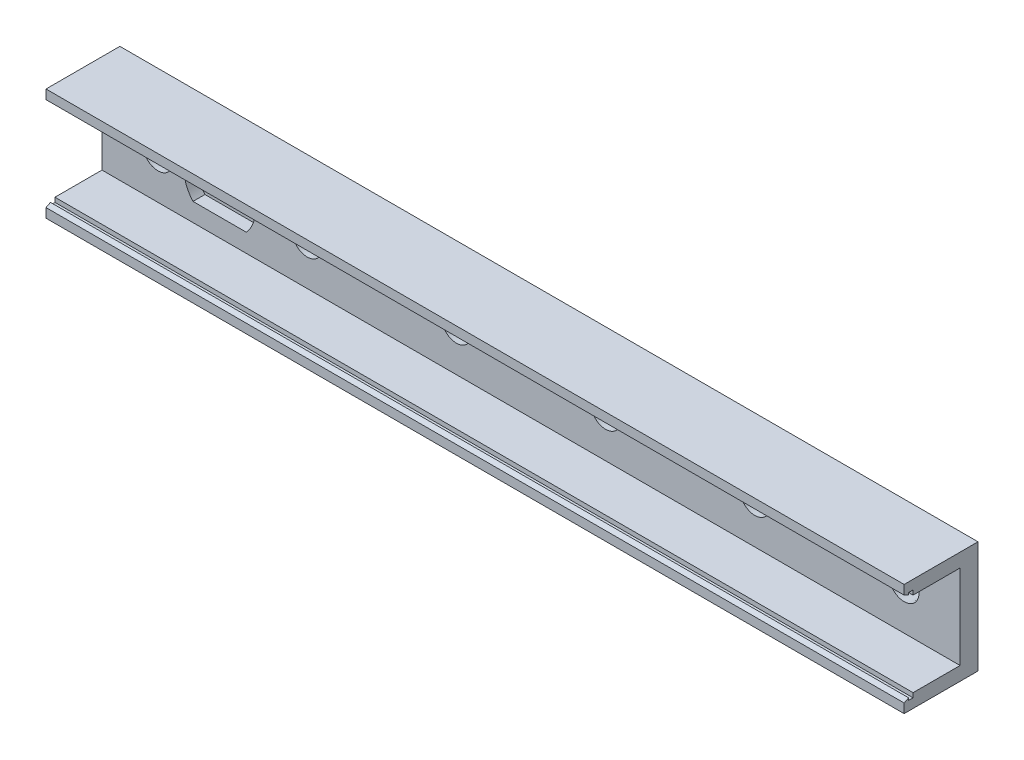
from build123d import *

# Parameters (mm, degrees)
SKETCH1_W                    = 146.05
SKETCH1_H                    = 19.05
BOSS_EXTRUDE1_DEPTH          = 3.048
CUT_EXTRUDE1_DEPTH           = 2.032
SKETCH3_R                    = 3.556
CUT_EXTRUDE2_DEPTH           = 148.301167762
SKETCH4_R                    = 2.54
CUT_EXTRUDE3_DEPTH           = 148.318686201
CUT_EXTRUDE3_DRAFT           = 3
CUT_EXTRUDE3_PROFILE_2_DEPTH = 148.318686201
CUT_EXTRUDE3_PROFILE_2_DRAFT = 3
CUT_EXTRUDE3_PROFILE_3_DEPTH = 148.318686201
CUT_EXTRUDE3_PROFILE_3_DRAFT = 3
CUT_EXTRUDE3_PROFILE_4_DEPTH = 148.318686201
CUT_EXTRUDE3_PROFILE_4_DRAFT = 3
CUT_EXTRUDE3_PROFILE_5_DEPTH = 148.318686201
CUT_EXTRUDE3_PROFILE_5_DRAFT = 3
CUT_EXTRUDE3_PROFILE_6_DEPTH = 148.318686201
CUT_EXTRUDE3_PROFILE_6_DRAFT = 3
BOSS_EXTRUDE2_DEPTH          = 146.05


with BuildPart() as part:
    # Sketch1 → Boss-Extrude1 (new body)
    with BuildSketch(Plane.XY):
        with Locations((73.025, 9.525)):
            Rectangle(SKETCH1_W, SKETCH1_H)
    extrude(amount=BOSS_EXTRUDE1_DEPTH)

    # Sketch2 → Cut-Extrude1 (cut)
    with BuildSketch(Plane.XY.offset(3.048)):
        with BuildLine():
            Line((15.487003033, 5.461), (24.574383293, 5.461))
            ThreePointArc((24.574383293, 5.461), (26.126693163, 9.525), (24.574383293, 13.589))
            Line((24.574383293, 13.589), (15.487003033, 13.589))
            ThreePointArc((15.487003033, 13.589), (13.934693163, 9.525), (15.487003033, 5.461))
        make_face()
    extrude(amount=-CUT_EXTRUDE1_DEPTH, mode=Mode.SUBTRACT)

    # Sketch3 → Cut-Extrude2 (cut, through all)
    with BuildSketch(Plane.XY.offset(1.016)):
        with Locations((20.030693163, 9.525)):
            Circle(SKETCH3_R)
    extrude(amount=-CUT_EXTRUDE2_DEPTH, mode=Mode.SUBTRACT)


with BuildPart() as cut_extrude3_tool:
    # Sketch4 → Cut-Extrude3 (with draft: the straight prism first)
    with BuildSketch(Plane.XY.offset(3.048)):
        with Locations((9.525, 9.525)):
            Circle(SKETCH4_R)
    extrude(amount=-CUT_EXTRUDE3_DEPTH)
    # Cut-Extrude3: the draft: its side faces are tilted about the plane it starts from
    cut_extrude3_sides = [cut_extrude3_tool.faces().sort_by_distance(p)[0] for p in [
        (6.985, 9.525, -71.111343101),
    ]]
    draft(cut_extrude3_sides, Plane.XY.offset(3.048), CUT_EXTRUDE3_DRAFT)


with BuildPart() as part_1:
    add(part.part)

    # Cut-Extrude3: cut by cut_extrude3_tool
    add(cut_extrude3_tool.part, mode=Mode.SUBTRACT)


with BuildPart() as cut_extrude3_profile_2_tool:
    # Sketch4 → Cut-Extrude3 profile 2 (with draft: the straight prism first)
    with BuildSketch(Plane.XY.offset(3.048)):
        with Locations((34.925, 9.525)):
            Circle(SKETCH4_R)
    extrude(amount=-CUT_EXTRUDE3_PROFILE_2_DEPTH)
    # Cut-Extrude3 profile 2: the draft: its side faces are tilted about the plane it starts from
    cut_extrude3_profile_2_sides = [cut_extrude3_profile_2_tool.faces().sort_by_distance(p)[0] for p in [
        (32.385, 9.525, -71.111343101),
    ]]
    draft(cut_extrude3_profile_2_sides, Plane.XY.offset(3.048), CUT_EXTRUDE3_PROFILE_2_DRAFT)


with BuildPart() as part_2:
    add(part_1.part)

    # Cut-Extrude3 profile 2: cut by cut_extrude3_profile_2_tool
    add(cut_extrude3_profile_2_tool.part, mode=Mode.SUBTRACT)


with BuildPart() as cut_extrude3_profile_3_tool:
    # Sketch4 → Cut-Extrude3 profile 3 (with draft: the straight prism first)
    with BuildSketch(Plane.XY.offset(3.048)):
        with Locations((60.325, 9.525)):
            Circle(SKETCH4_R)
    extrude(amount=-CUT_EXTRUDE3_PROFILE_3_DEPTH)
    # Cut-Extrude3 profile 3: the draft: its side faces are tilted about the plane it starts from
    cut_extrude3_profile_3_sides = [cut_extrude3_profile_3_tool.faces().sort_by_distance(p)[0] for p in [
        (57.785, 9.525, -71.111343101),
    ]]
    draft(cut_extrude3_profile_3_sides, Plane.XY.offset(3.048), CUT_EXTRUDE3_PROFILE_3_DRAFT)


with BuildPart() as part_3:
    add(part_2.part)

    # Cut-Extrude3 profile 3: cut by cut_extrude3_profile_3_tool
    add(cut_extrude3_profile_3_tool.part, mode=Mode.SUBTRACT)


with BuildPart() as cut_extrude3_profile_4_tool:
    # Sketch4 → Cut-Extrude3 profile 4 (with draft: the straight prism first)
    with BuildSketch(Plane.XY.offset(3.048)):
        with Locations((85.725, 9.525)):
            Circle(SKETCH4_R)
    extrude(amount=-CUT_EXTRUDE3_PROFILE_4_DEPTH)
    # Cut-Extrude3 profile 4: the draft: its side faces are tilted about the plane it starts from
    cut_extrude3_profile_4_sides = [cut_extrude3_profile_4_tool.faces().sort_by_distance(p)[0] for p in [
        (83.185, 9.525, -71.111343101),
    ]]
    draft(cut_extrude3_profile_4_sides, Plane.XY.offset(3.048), CUT_EXTRUDE3_PROFILE_4_DRAFT)


with BuildPart() as part_4:
    add(part_3.part)

    # Cut-Extrude3 profile 4: cut by cut_extrude3_profile_4_tool
    add(cut_extrude3_profile_4_tool.part, mode=Mode.SUBTRACT)


with BuildPart() as cut_extrude3_profile_5_tool:
    # Sketch4 → Cut-Extrude3 profile 5 (with draft: the straight prism first)
    with BuildSketch(Plane.XY.offset(3.048)):
        with Locations((111.125, 9.525)):
            Circle(SKETCH4_R)
    extrude(amount=-CUT_EXTRUDE3_PROFILE_5_DEPTH)
    # Cut-Extrude3 profile 5: the draft: its side faces are tilted about the plane it starts from
    cut_extrude3_profile_5_sides = [cut_extrude3_profile_5_tool.faces().sort_by_distance(p)[0] for p in [
        (108.585, 9.525, -71.111343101),
    ]]
    draft(cut_extrude3_profile_5_sides, Plane.XY.offset(3.048), CUT_EXTRUDE3_PROFILE_5_DRAFT)


with BuildPart() as part_5:
    add(part_4.part)

    # Cut-Extrude3 profile 5: cut by cut_extrude3_profile_5_tool
    add(cut_extrude3_profile_5_tool.part, mode=Mode.SUBTRACT)


with BuildPart() as cut_extrude3_profile_6_tool:
    # Sketch4 → Cut-Extrude3 profile 6 (with draft: the straight prism first)
    with BuildSketch(Plane.XY.offset(3.048)):
        with Locations((136.525, 9.525)):
            Circle(SKETCH4_R)
    extrude(amount=-CUT_EXTRUDE3_PROFILE_6_DEPTH)
    # Cut-Extrude3 profile 6: the draft: its side faces are tilted about the plane it starts from
    cut_extrude3_profile_6_sides = [cut_extrude3_profile_6_tool.faces().sort_by_distance(p)[0] for p in [
        (133.985, 9.525, -71.111343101),
    ]]
    draft(cut_extrude3_profile_6_sides, Plane.XY.offset(3.048), CUT_EXTRUDE3_PROFILE_6_DRAFT)


with BuildPart() as part_6:
    add(part_5.part)

    # Cut-Extrude3 profile 6: cut by cut_extrude3_profile_6_tool
    add(cut_extrude3_profile_6_tool.part, mode=Mode.SUBTRACT)

    # Sketch5 → Boss-Extrude2 (add)
    with BuildSketch(Plane(origin=(0, 0, 0), x_dir=(0, 0, -1), z_dir=(1, 0, 0))):
        Polygon((-11.049, 16.7132), (-3.048, 16.7132), (-3.048, 19.05), (-12.573, 19.05), (-12.573, 17.4752), (-11.811, 17.0942), (-11.811, 17.4752), (-11.049, 17.4752), align=None)
        Polygon((-11.049, 2.3368), (-11.049, 1.5748), (-11.811, 1.5748), (-11.811, 1.9558), (-12.573, 1.5748), (-12.573, 0), (-3.048, 0), (-3.048, 2.3368), align=None)
    extrude(amount=BOSS_EXTRUDE2_DEPTH)


solid = part_6.part
